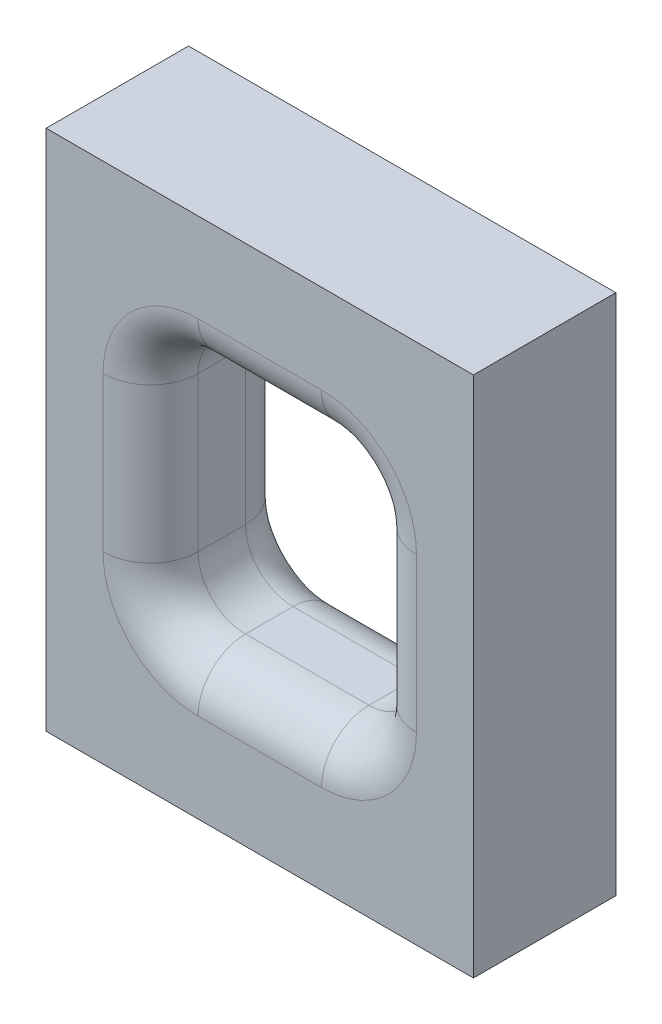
ISO-10303-21;
HEADER;
FILE_DESCRIPTION(('STEP AP214'),'2;1');
FILE_NAME('part.step','',(''),(''),'','','');
FILE_SCHEMA(('AUTOMOTIVE_DESIGN { 1 0 10303 214 1 1 1 1 }'));
ENDSEC;
DATA;
#1=APPLICATION_CONTEXT('core data for automotive mechanical design processes');
#2=APPLICATION_PROTOCOL_DEFINITION('international standard','automotive_design',2000,#1);
#3=PRODUCT_CONTEXT('',#1,'mechanical');
#4=PRODUCT('Part','Part','',(#3));
#5=PRODUCT_RELATED_PRODUCT_CATEGORY('part','',(#4));
#6=PRODUCT_DEFINITION_FORMATION('','',#4);
#7=PRODUCT_DEFINITION_CONTEXT('part definition',#1,'design');
#8=PRODUCT_DEFINITION('design','',#6,#7);
#9=PRODUCT_DEFINITION_SHAPE('','',#8);
#10=(LENGTH_UNIT() NAMED_UNIT(*) SI_UNIT(.MILLI.,.METRE.));
#11=(NAMED_UNIT(*) PLANE_ANGLE_UNIT() SI_UNIT($,.RADIAN.));
#12=(NAMED_UNIT(*) SI_UNIT($,.STERADIAN.) SOLID_ANGLE_UNIT());
#13=UNCERTAINTY_MEASURE_WITH_UNIT(LENGTH_MEASURE(1.E-05),#10,'distance_accuracy_value','');
#14=(GEOMETRIC_REPRESENTATION_CONTEXT(3) GLOBAL_UNCERTAINTY_ASSIGNED_CONTEXT((#13)) GLOBAL_UNIT_ASSIGNED_CONTEXT((#10,
#11,#12)) REPRESENTATION_CONTEXT('',''));
#15=CARTESIAN_POINT('',(0.,0.,0.));
#16=DIRECTION('',(0.,0.,1.));
#17=DIRECTION('',(1.,0.,0.));
#18=AXIS2_PLACEMENT_3D('',#15,#16,#17);
#19=CARTESIAN_POINT('',(0.,0.,3.));
#20=DIRECTION('',(0.,0.,-1.));
#21=DIRECTION('',(-1.,0.,0.));
#22=AXIS2_PLACEMENT_3D('',#19,#20,#21);
#23=PLANE('',#22);
#24=DIRECTION('',(0.,1.,0.));
#25=VECTOR('',#24,1.);
#26=CARTESIAN_POINT('',(3.3,-1.625,3.));
#27=LINE('',#26,#25);
#28=CARTESIAN_POINT('',(3.3,1.625,3.));
#29=VERTEX_POINT('',#28);
#30=CARTESIAN_POINT('',(3.3,-1.625,3.));
#31=VERTEX_POINT('',#30);
#32=EDGE_CURVE('E252',#29,#31,#27,.F.);
#33=ORIENTED_EDGE('',*,*,#32,.T.);
#34=CARTESIAN_POINT('',(1.3,-1.625,3.));
#35=DIRECTION('',(0.,0.,-1.));
#36=DIRECTION('',(-1.,0.,0.));
#37=AXIS2_PLACEMENT_3D('',#34,#35,#36);
#38=CIRCLE('',#37,2.);
#39=CARTESIAN_POINT('',(1.29999999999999,-3.625,3.));
#40=VERTEX_POINT('',#39);
#41=EDGE_CURVE('E263',#31,#40,#38,.T.);
#42=ORIENTED_EDGE('',*,*,#41,.T.);
#43=DIRECTION('',(1.,0.,0.));
#44=VECTOR('',#43,1.);
#45=CARTESIAN_POINT('',(-1.29999999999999,-3.625,3.));
#46=LINE('',#45,#44);
#47=CARTESIAN_POINT('',(-1.29999999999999,-3.625,3.));
#48=VERTEX_POINT('',#47);
#49=EDGE_CURVE('E57',#40,#48,#46,.F.);
#50=ORIENTED_EDGE('',*,*,#49,.T.);
#51=CARTESIAN_POINT('',(-1.3,-1.625,3.));
#52=DIRECTION('',(0.,0.,-1.));
#53=DIRECTION('',(-1.,0.,0.));
#54=AXIS2_PLACEMENT_3D('',#51,#52,#53);
#55=CIRCLE('',#54,2.);
#56=CARTESIAN_POINT('',(-3.3,-1.62499999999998,3.));
#57=VERTEX_POINT('',#56);
#58=EDGE_CURVE('E260',#48,#57,#55,.T.);
#59=ORIENTED_EDGE('',*,*,#58,.T.);
#60=DIRECTION('',(0.,-1.,0.));
#61=VECTOR('',#60,1.);
#62=CARTESIAN_POINT('',(-3.3,1.62499999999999,3.));
#63=LINE('',#62,#61);
#64=CARTESIAN_POINT('',(-3.3,1.62499999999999,3.));
#65=VERTEX_POINT('',#64);
#66=EDGE_CURVE('E258',#57,#65,#63,.F.);
#67=ORIENTED_EDGE('',*,*,#66,.T.);
#68=CARTESIAN_POINT('',(-1.3,1.625,3.));
#69=DIRECTION('',(0.,0.,-1.));
#70=DIRECTION('',(-1.,0.,0.));
#71=AXIS2_PLACEMENT_3D('',#68,#69,#70);
#72=CIRCLE('',#71,2.);
#73=CARTESIAN_POINT('',(-1.29999999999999,3.625,3.));
#74=VERTEX_POINT('',#73);
#75=EDGE_CURVE('E256',#65,#74,#72,.T.);
#76=ORIENTED_EDGE('',*,*,#75,.T.);
#77=DIRECTION('',(-1.,0.,0.));
#78=VECTOR('',#77,1.);
#79=CARTESIAN_POINT('',(1.29999999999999,3.625,3.));
#80=LINE('',#79,#78);
#81=CARTESIAN_POINT('',(1.29999999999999,3.625,3.));
#82=VERTEX_POINT('',#81);
#83=EDGE_CURVE('E254',#74,#82,#80,.F.);
#84=ORIENTED_EDGE('',*,*,#83,.T.);
#85=CARTESIAN_POINT('',(1.3,1.625,3.));
#86=DIRECTION('',(0.,0.,-1.));
#87=DIRECTION('',(-1.,0.,0.));
#88=AXIS2_PLACEMENT_3D('',#85,#86,#87);
#89=CIRCLE('',#88,2.);
#90=EDGE_CURVE('E250',#82,#29,#89,.T.);
#91=ORIENTED_EDGE('',*,*,#90,.T.);
#92=EDGE_LOOP('',(#33,#42,#50,#59,#67,#76,#84,#91));
#93=FACE_BOUND('',#92,.T.);
#94=DIRECTION('',(1.,0.,0.));
#95=VECTOR('',#94,1.);
#96=CARTESIAN_POINT('',(-4.5,-5.5,3.));
#97=LINE('',#96,#95);
#98=CARTESIAN_POINT('',(-4.5,-5.5,3.));
#99=VERTEX_POINT('',#98);
#100=CARTESIAN_POINT('',(4.5,-5.5,3.));
#101=VERTEX_POINT('',#100);
#102=EDGE_CURVE('E185',#99,#101,#97,.T.);
#103=ORIENTED_EDGE('',*,*,#102,.T.);
#104=DIRECTION('',(0.,1.,0.));
#105=VECTOR('',#104,1.);
#106=CARTESIAN_POINT('',(4.5,-4.49999999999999,3.));
#107=LINE('',#106,#105);
#108=CARTESIAN_POINT('',(4.49999999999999,5.5,3.));
#109=VERTEX_POINT('',#108);
#110=EDGE_CURVE('E173',#101,#109,#107,.T.);
#111=ORIENTED_EDGE('',*,*,#110,.T.);
#112=DIRECTION('',(-1.,0.,0.));
#113=VECTOR('',#112,1.);
#114=CARTESIAN_POINT('',(3.49999999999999,5.5,3.));
#115=LINE('',#114,#113);
#116=CARTESIAN_POINT('',(-4.50000000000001,5.5,3.));
#117=VERTEX_POINT('',#116);
#118=EDGE_CURVE('E184',#109,#117,#115,.T.);
#119=ORIENTED_EDGE('',*,*,#118,.T.);
#120=DIRECTION('',(0.,-1.,0.));
#121=VECTOR('',#120,1.);
#122=CARTESIAN_POINT('',(-4.50000000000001,4.5,3.));
#123=LINE('',#122,#121);
#124=EDGE_CURVE('E189',#117,#99,#123,.T.);
#125=ORIENTED_EDGE('',*,*,#124,.T.);
#126=EDGE_LOOP('',(#103,#111,#119,#125));
#127=FACE_BOUND('',#126,.T.);
#128=ADVANCED_FACE('F33',(#93,#127),#23,.F.);
#129=CARTESIAN_POINT('',(0.,0.,0.));
#130=DIRECTION('',(0.,0.,-1.));
#131=DIRECTION('',(-1.,0.,0.));
#132=AXIS2_PLACEMENT_3D('',#129,#130,#131);
#133=PLANE('',#132);
#134=DIRECTION('',(1.,0.,0.));
#135=VECTOR('',#134,1.);
#136=CARTESIAN_POINT('',(0.,-3.625,0.));
#137=LINE('',#136,#135);
#138=CARTESIAN_POINT('',(-1.29999999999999,-3.625,0.));
#139=VERTEX_POINT('',#138);
#140=CARTESIAN_POINT('',(1.29999999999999,-3.625,0.));
#141=VERTEX_POINT('',#140);
#142=EDGE_CURVE('E215',#139,#141,#137,.T.);
#143=ORIENTED_EDGE('',*,*,#142,.T.);
#144=CARTESIAN_POINT('',(1.3,-1.625,0.));
#145=DIRECTION('',(0.,0.,-1.));
#146=DIRECTION('',(-1.,0.,0.));
#147=AXIS2_PLACEMENT_3D('',#144,#145,#146);
#148=CIRCLE('',#147,2.);
#149=CARTESIAN_POINT('',(3.3,-1.625,0.));
#150=VERTEX_POINT('',#149);
#151=EDGE_CURVE('E217',#141,#150,#148,.F.);
#152=ORIENTED_EDGE('',*,*,#151,.T.);
#153=DIRECTION('',(0.,1.,0.));
#154=VECTOR('',#153,1.);
#155=CARTESIAN_POINT('',(3.3,0.,0.));
#156=LINE('',#155,#154);
#157=CARTESIAN_POINT('',(3.3,1.62499999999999,0.));
#158=VERTEX_POINT('',#157);
#159=EDGE_CURVE('E198',#150,#158,#156,.T.);
#160=ORIENTED_EDGE('',*,*,#159,.T.);
#161=CARTESIAN_POINT('',(1.3,1.625,0.));
#162=DIRECTION('',(0.,0.,-1.));
#163=DIRECTION('',(-1.,0.,0.));
#164=AXIS2_PLACEMENT_3D('',#161,#162,#163);
#165=CIRCLE('',#164,2.);
#166=CARTESIAN_POINT('',(1.29999999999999,3.625,0.));
#167=VERTEX_POINT('',#166);
#168=EDGE_CURVE('E200',#158,#167,#165,.F.);
#169=ORIENTED_EDGE('',*,*,#168,.T.);
#170=DIRECTION('',(-1.,0.,0.));
#171=VECTOR('',#170,1.);
#172=CARTESIAN_POINT('',(0.,3.625,0.));
#173=LINE('',#172,#171);
#174=CARTESIAN_POINT('',(-1.29999999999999,3.625,0.));
#175=VERTEX_POINT('',#174);
#176=EDGE_CURVE('E207',#167,#175,#173,.T.);
#177=ORIENTED_EDGE('',*,*,#176,.T.);
#178=CARTESIAN_POINT('',(-1.3,1.625,0.));
#179=DIRECTION('',(0.,0.,-1.));
#180=DIRECTION('',(-1.,0.,0.));
#181=AXIS2_PLACEMENT_3D('',#178,#179,#180);
#182=CIRCLE('',#181,2.);
#183=CARTESIAN_POINT('',(-3.3,1.62499999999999,0.));
#184=VERTEX_POINT('',#183);
#185=EDGE_CURVE('E209',#175,#184,#182,.F.);
#186=ORIENTED_EDGE('',*,*,#185,.T.);
#187=DIRECTION('',(0.,-1.,0.));
#188=VECTOR('',#187,1.);
#189=CARTESIAN_POINT('',(-3.3,0.,0.));
#190=LINE('',#189,#188);
#191=CARTESIAN_POINT('',(-3.3,-1.62499999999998,0.));
#192=VERTEX_POINT('',#191);
#193=EDGE_CURVE('E211',#184,#192,#190,.T.);
#194=ORIENTED_EDGE('',*,*,#193,.T.);
#195=CARTESIAN_POINT('',(-1.3,-1.625,0.));
#196=DIRECTION('',(0.,0.,-1.));
#197=DIRECTION('',(-1.,0.,0.));
#198=AXIS2_PLACEMENT_3D('',#195,#196,#197);
#199=CIRCLE('',#198,2.);
#200=EDGE_CURVE('E213',#192,#139,#199,.F.);
#201=ORIENTED_EDGE('',*,*,#200,.T.);
#202=EDGE_LOOP('',(#143,#152,#160,#169,#177,#186,#194,#201));
#203=FACE_BOUND('',#202,.T.);
#204=DIRECTION('',(1.,0.,0.));
#205=VECTOR('',#204,1.);
#206=CARTESIAN_POINT('',(-4.5,-5.5,0.));
#207=LINE('',#206,#205);
#208=CARTESIAN_POINT('',(-4.5,-5.5,0.));
#209=VERTEX_POINT('',#208);
#210=CARTESIAN_POINT('',(4.5,-5.5,0.));
#211=VERTEX_POINT('',#210);
#212=EDGE_CURVE('E197',#209,#211,#207,.T.);
#213=ORIENTED_EDGE('',*,*,#212,.F.);
#214=DIRECTION('',(0.,-1.,0.));
#215=VECTOR('',#214,1.);
#216=CARTESIAN_POINT('',(-4.5,-5.5,0.));
#217=LINE('',#216,#215);
#218=CARTESIAN_POINT('',(-4.50000000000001,5.5,0.));
#219=VERTEX_POINT('',#218);
#220=EDGE_CURVE('E193',#219,#209,#217,.T.);
#221=ORIENTED_EDGE('',*,*,#220,.F.);
#222=DIRECTION('',(-1.,0.,0.));
#223=VECTOR('',#222,1.);
#224=CARTESIAN_POINT('',(-4.50000000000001,5.5,0.));
#225=LINE('',#224,#223);
#226=CARTESIAN_POINT('',(4.49999999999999,5.5,0.));
#227=VERTEX_POINT('',#226);
#228=EDGE_CURVE('E364',#227,#219,#225,.T.);
#229=ORIENTED_EDGE('',*,*,#228,.F.);
#230=DIRECTION('',(0.,1.,0.));
#231=VECTOR('',#230,1.);
#232=CARTESIAN_POINT('',(4.49999999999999,5.5,0.));
#233=LINE('',#232,#231);
#234=EDGE_CURVE('E362',#211,#227,#233,.T.);
#235=ORIENTED_EDGE('',*,*,#234,.F.);
#236=EDGE_LOOP('',(#213,#221,#229,#235));
#237=FACE_BOUND('',#236,.T.);
#238=ADVANCED_FACE('F375',(#203,#237),#133,.T.);
#239=CARTESIAN_POINT('',(-4.5,-5.5,3.));
#240=DIRECTION('',(0.,1.,0.));
#241=DIRECTION('',(0.,0.,1.));
#242=AXIS2_PLACEMENT_3D('',#239,#240,#241);
#243=PLANE('',#242);
#244=ORIENTED_EDGE('',*,*,#212,.T.);
#245=DIRECTION('',(0.,0.,-1.));
#246=VECTOR('',#245,1.);
#247=CARTESIAN_POINT('',(4.5,-5.5,3.));
#248=LINE('',#247,#246);
#249=EDGE_CURVE('E178',#101,#211,#248,.T.);
#250=ORIENTED_EDGE('',*,*,#249,.F.);
#251=ORIENTED_EDGE('',*,*,#102,.F.);
#252=DIRECTION('',(0.,0.,-1.));
#253=VECTOR('',#252,1.);
#254=CARTESIAN_POINT('',(-4.5,-5.5,3.));
#255=LINE('',#254,#253);
#256=EDGE_CURVE('E360',#99,#209,#255,.T.);
#257=ORIENTED_EDGE('',*,*,#256,.T.);
#258=EDGE_LOOP('',(#244,#250,#251,#257));
#259=FACE_BOUND('',#258,.T.);
#260=ADVANCED_FACE('F195',(#259),#243,.F.);
#261=CARTESIAN_POINT('',(4.49999999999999,5.5,3.));
#262=DIRECTION('',(-1.,0.,0.));
#263=DIRECTION('',(0.,0.,1.));
#264=AXIS2_PLACEMENT_3D('',#261,#262,#263);
#265=PLANE('',#264);
#266=ORIENTED_EDGE('',*,*,#234,.T.);
#267=DIRECTION('',(0.,0.,-1.));
#268=VECTOR('',#267,1.);
#269=CARTESIAN_POINT('',(4.49999999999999,5.5,3.));
#270=LINE('',#269,#268);
#271=EDGE_CURVE('E181',#109,#227,#270,.T.);
#272=ORIENTED_EDGE('',*,*,#271,.F.);
#273=ORIENTED_EDGE('',*,*,#110,.F.);
#274=ORIENTED_EDGE('',*,*,#249,.T.);
#275=EDGE_LOOP('',(#266,#272,#273,#274));
#276=FACE_BOUND('',#275,.T.);
#277=ADVANCED_FACE('F176',(#276),#265,.F.);
#278=CARTESIAN_POINT('',(-4.50000000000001,5.5,3.));
#279=DIRECTION('',(0.,-1.,0.));
#280=DIRECTION('',(0.,0.,-1.));
#281=AXIS2_PLACEMENT_3D('',#278,#279,#280);
#282=PLANE('',#281);
#283=ORIENTED_EDGE('',*,*,#228,.T.);
#284=DIRECTION('',(0.,0.,-1.));
#285=VECTOR('',#284,1.);
#286=CARTESIAN_POINT('',(-4.50000000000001,5.5,3.));
#287=LINE('',#286,#285);
#288=EDGE_CURVE('E202',#117,#219,#287,.T.);
#289=ORIENTED_EDGE('',*,*,#288,.F.);
#290=ORIENTED_EDGE('',*,*,#118,.F.);
#291=ORIENTED_EDGE('',*,*,#271,.T.);
#292=EDGE_LOOP('',(#283,#289,#290,#291));
#293=FACE_BOUND('',#292,.T.);
#294=ADVANCED_FACE('F373',(#293),#282,.F.);
#295=CARTESIAN_POINT('',(-4.5,-5.5,3.));
#296=DIRECTION('',(1.,0.,0.));
#297=DIRECTION('',(0.,0.,-1.));
#298=AXIS2_PLACEMENT_3D('',#295,#296,#297);
#299=PLANE('',#298);
#300=ORIENTED_EDGE('',*,*,#220,.T.);
#301=ORIENTED_EDGE('',*,*,#256,.F.);
#302=ORIENTED_EDGE('',*,*,#124,.F.);
#303=ORIENTED_EDGE('',*,*,#288,.T.);
#304=EDGE_LOOP('',(#300,#301,#302,#303));
#305=FACE_BOUND('',#304,.T.);
#306=ADVANCED_FACE('F371',(#305),#299,.F.);
#307=CARTESIAN_POINT('',(1.3,1.625,3.));
#308=DIRECTION('',(0.,0.,-1.));
#309=DIRECTION('',(-1.,0.,0.));
#310=AXIS2_PLACEMENT_3D('',#307,#308,#309);
#311=CYLINDRICAL_SURFACE('',#310,1.);
#312=DIRECTION('',(0.,0.,-1.));
#313=VECTOR('',#312,1.);
#314=CARTESIAN_POINT('',(1.29999999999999,2.625,3.));
#315=LINE('',#314,#313);
#316=CARTESIAN_POINT('',(1.29999999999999,2.625,2.));
#317=VERTEX_POINT('',#316);
#318=CARTESIAN_POINT('',(1.29999999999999,2.625,1.));
#319=VERTEX_POINT('',#318);
#320=EDGE_CURVE('E355',#317,#319,#315,.T.);
#321=ORIENTED_EDGE('',*,*,#320,.T.);
#322=CARTESIAN_POINT('',(1.3,1.625,1.));
#323=DIRECTION('',(0.,0.,-1.));
#324=DIRECTION('',(-1.,0.,0.));
#325=AXIS2_PLACEMENT_3D('',#322,#323,#324);
#326=CIRCLE('',#325,1.);
#327=CARTESIAN_POINT('',(2.3,1.625,1.));
#328=VERTEX_POINT('',#327);
#329=EDGE_CURVE('E248',#319,#328,#326,.T.);
#330=ORIENTED_EDGE('',*,*,#329,.T.);
#331=DIRECTION('',(0.,0.,-1.));
#332=VECTOR('',#331,1.);
#333=CARTESIAN_POINT('',(2.3,1.625,3.));
#334=LINE('',#333,#332);
#335=CARTESIAN_POINT('',(2.3,1.625,2.));
#336=VERTEX_POINT('',#335);
#337=EDGE_CURVE('E288',#336,#328,#334,.T.);
#338=ORIENTED_EDGE('',*,*,#337,.F.);
#339=CARTESIAN_POINT('',(1.3,1.625,2.));
#340=DIRECTION('',(0.,0.,-1.));
#341=DIRECTION('',(-1.,0.,0.));
#342=AXIS2_PLACEMENT_3D('',#339,#340,#341);
#343=CIRCLE('',#342,1.);
#344=EDGE_CURVE('E246',#336,#317,#343,.F.);
#345=ORIENTED_EDGE('',*,*,#344,.T.);
#346=EDGE_LOOP('',(#321,#330,#338,#345));
#347=FACE_BOUND('',#346,.T.);
#348=ADVANCED_FACE('F389',(#347),#311,.F.);
#349=CARTESIAN_POINT('',(-1.29999999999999,2.625,3.));
#350=DIRECTION('',(0.,-1.,0.));
#351=DIRECTION('',(0.,0.,-1.));
#352=AXIS2_PLACEMENT_3D('',#349,#350,#351);
#353=PLANE('',#352);
#354=DIRECTION('',(0.,0.,-1.));
#355=VECTOR('',#354,1.);
#356=CARTESIAN_POINT('',(-1.29999999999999,2.625,3.));
#357=LINE('',#356,#355);
#358=CARTESIAN_POINT('',(-1.29999999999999,2.625,2.));
#359=VERTEX_POINT('',#358);
#360=CARTESIAN_POINT('',(-1.29999999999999,2.625,1.));
#361=VERTEX_POINT('',#360);
#362=EDGE_CURVE('E352',#359,#361,#357,.T.);
#363=ORIENTED_EDGE('',*,*,#362,.T.);
#364=DIRECTION('',(-1.,0.,0.));
#365=VECTOR('',#364,1.);
#366=CARTESIAN_POINT('',(-1.29999999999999,2.625,1.));
#367=LINE('',#366,#365);
#368=EDGE_CURVE('E244',#361,#319,#367,.F.);
#369=ORIENTED_EDGE('',*,*,#368,.T.);
#370=ORIENTED_EDGE('',*,*,#320,.F.);
#371=DIRECTION('',(-1.,0.,0.));
#372=VECTOR('',#371,1.);
#373=CARTESIAN_POINT('',(-1.29999999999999,2.625,2.));
#374=LINE('',#373,#372);
#375=EDGE_CURVE('E242',#317,#359,#374,.T.);
#376=ORIENTED_EDGE('',*,*,#375,.T.);
#377=EDGE_LOOP('',(#363,#369,#370,#376));
#378=FACE_BOUND('',#377,.T.);
#379=ADVANCED_FACE('F524',(#378),#353,.T.);
#380=CARTESIAN_POINT('',(-1.3,1.625,3.));
#381=DIRECTION('',(0.,0.,-1.));
#382=DIRECTION('',(-1.,0.,0.));
#383=AXIS2_PLACEMENT_3D('',#380,#381,#382);
#384=CYLINDRICAL_SURFACE('',#383,1.);
#385=DIRECTION('',(0.,0.,-1.));
#386=VECTOR('',#385,1.);
#387=CARTESIAN_POINT('',(-2.3,1.62499999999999,3.));
#388=LINE('',#387,#386);
#389=CARTESIAN_POINT('',(-2.3,1.62499999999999,2.));
#390=VERTEX_POINT('',#389);
#391=CARTESIAN_POINT('',(-2.3,1.62499999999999,1.));
#392=VERTEX_POINT('',#391);
#393=EDGE_CURVE('E349',#390,#392,#388,.T.);
#394=ORIENTED_EDGE('',*,*,#393,.T.);
#395=CARTESIAN_POINT('',(-1.3,1.625,1.));
#396=DIRECTION('',(0.,0.,-1.));
#397=DIRECTION('',(-1.,0.,0.));
#398=AXIS2_PLACEMENT_3D('',#395,#396,#397);
#399=CIRCLE('',#398,1.);
#400=EDGE_CURVE('E240',#392,#361,#399,.T.);
#401=ORIENTED_EDGE('',*,*,#400,.T.);
#402=ORIENTED_EDGE('',*,*,#362,.F.);
#403=CARTESIAN_POINT('',(-1.3,1.625,2.));
#404=DIRECTION('',(0.,0.,-1.));
#405=DIRECTION('',(-1.,0.,0.));
#406=AXIS2_PLACEMENT_3D('',#403,#404,#405);
#407=CIRCLE('',#406,1.);
#408=EDGE_CURVE('E238',#359,#390,#407,.F.);
#409=ORIENTED_EDGE('',*,*,#408,.T.);
#410=EDGE_LOOP('',(#394,#401,#402,#409));
#411=FACE_BOUND('',#410,.T.);
#412=ADVANCED_FACE('F516',(#411),#384,.F.);
#413=CARTESIAN_POINT('',(-2.3,1.62499999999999,3.));
#414=DIRECTION('',(1.,0.,0.));
#415=DIRECTION('',(0.,1.,0.));
#416=AXIS2_PLACEMENT_3D('',#413,#414,#415);
#417=PLANE('',#416);
#418=DIRECTION('',(0.,0.,-1.));
#419=VECTOR('',#418,1.);
#420=CARTESIAN_POINT('',(-2.3,-1.62499999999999,3.));
#421=LINE('',#420,#419);
#422=CARTESIAN_POINT('',(-2.3,-1.62499999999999,2.));
#423=VERTEX_POINT('',#422);
#424=CARTESIAN_POINT('',(-2.3,-1.62499999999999,1.));
#425=VERTEX_POINT('',#424);
#426=EDGE_CURVE('E342',#423,#425,#421,.T.);
#427=ORIENTED_EDGE('',*,*,#426,.T.);
#428=DIRECTION('',(0.,-1.,0.));
#429=VECTOR('',#428,1.);
#430=CARTESIAN_POINT('',(-2.3,1.62499999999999,1.));
#431=LINE('',#430,#429);
#432=EDGE_CURVE('E236',#425,#392,#431,.F.);
#433=ORIENTED_EDGE('',*,*,#432,.T.);
#434=ORIENTED_EDGE('',*,*,#393,.F.);
#435=DIRECTION('',(0.,-1.,0.));
#436=VECTOR('',#435,1.);
#437=CARTESIAN_POINT('',(-2.3,-1.62499999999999,2.));
#438=LINE('',#437,#436);
#439=EDGE_CURVE('E234',#390,#423,#438,.T.);
#440=ORIENTED_EDGE('',*,*,#439,.T.);
#441=EDGE_LOOP('',(#427,#433,#434,#440));
#442=FACE_BOUND('',#441,.T.);
#443=ADVANCED_FACE('F508',(#442),#417,.T.);
#444=CARTESIAN_POINT('',(-1.3,-1.625,3.));
#445=DIRECTION('',(0.,0.,-1.));
#446=DIRECTION('',(-1.,0.,0.));
#447=AXIS2_PLACEMENT_3D('',#444,#445,#446);
#448=CYLINDRICAL_SURFACE('',#447,1.);
#449=DIRECTION('',(0.,0.,-1.));
#450=VECTOR('',#449,1.);
#451=CARTESIAN_POINT('',(-1.29999999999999,-2.625,3.));
#452=LINE('',#451,#450);
#453=CARTESIAN_POINT('',(-1.29999999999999,-2.625,2.));
#454=VERTEX_POINT('',#453);
#455=CARTESIAN_POINT('',(-1.29999999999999,-2.625,1.));
#456=VERTEX_POINT('',#455);
#457=EDGE_CURVE('E334',#454,#456,#452,.T.);
#458=ORIENTED_EDGE('',*,*,#457,.T.);
#459=CARTESIAN_POINT('',(-1.3,-1.625,1.));
#460=DIRECTION('',(0.,0.,-1.));
#461=DIRECTION('',(-1.,0.,0.));
#462=AXIS2_PLACEMENT_3D('',#459,#460,#461);
#463=CIRCLE('',#462,1.);
#464=EDGE_CURVE('E232',#456,#425,#463,.T.);
#465=ORIENTED_EDGE('',*,*,#464,.T.);
#466=ORIENTED_EDGE('',*,*,#426,.F.);
#467=CARTESIAN_POINT('',(-1.3,-1.625,2.));
#468=DIRECTION('',(0.,0.,-1.));
#469=DIRECTION('',(-1.,0.,0.));
#470=AXIS2_PLACEMENT_3D('',#467,#468,#469);
#471=CIRCLE('',#470,1.);
#472=EDGE_CURVE('E230',#423,#454,#471,.F.);
#473=ORIENTED_EDGE('',*,*,#472,.T.);
#474=EDGE_LOOP('',(#458,#465,#466,#473));
#475=FACE_BOUND('',#474,.T.);
#476=ADVANCED_FACE('F501',(#475),#448,.F.);
#477=CARTESIAN_POINT('',(-1.29999999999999,-2.625,3.));
#478=DIRECTION('',(0.,1.,0.));
#479=DIRECTION('',(0.,0.,1.));
#480=AXIS2_PLACEMENT_3D('',#477,#478,#479);
#481=PLANE('',#480);
#482=DIRECTION('',(0.,0.,-1.));
#483=VECTOR('',#482,1.);
#484=CARTESIAN_POINT('',(1.29999999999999,-2.625,3.));
#485=LINE('',#484,#483);
#486=CARTESIAN_POINT('',(1.29999999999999,-2.625,2.));
#487=VERTEX_POINT('',#486);
#488=CARTESIAN_POINT('',(1.29999999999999,-2.625,1.));
#489=VERTEX_POINT('',#488);
#490=EDGE_CURVE('E332',#487,#489,#485,.T.);
#491=ORIENTED_EDGE('',*,*,#490,.T.);
#492=DIRECTION('',(1.,0.,0.));
#493=VECTOR('',#492,1.);
#494=CARTESIAN_POINT('',(-1.29999999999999,-2.625,1.));
#495=LINE('',#494,#493);
#496=EDGE_CURVE('E228',#489,#456,#495,.F.);
#497=ORIENTED_EDGE('',*,*,#496,.T.);
#498=ORIENTED_EDGE('',*,*,#457,.F.);
#499=DIRECTION('',(1.,0.,0.));
#500=VECTOR('',#499,1.);
#501=CARTESIAN_POINT('',(1.29999999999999,-2.625,2.));
#502=LINE('',#501,#500);
#503=EDGE_CURVE('E226',#454,#487,#502,.T.);
#504=ORIENTED_EDGE('',*,*,#503,.T.);
#505=EDGE_LOOP('',(#491,#497,#498,#504));
#506=FACE_BOUND('',#505,.T.);
#507=ADVANCED_FACE('F331',(#506),#481,.T.);
#508=CARTESIAN_POINT('',(1.3,-1.625,3.));
#509=DIRECTION('',(0.,0.,-1.));
#510=DIRECTION('',(-1.,0.,0.));
#511=AXIS2_PLACEMENT_3D('',#508,#509,#510);
#512=CYLINDRICAL_SURFACE('',#511,1.);
#513=DIRECTION('',(0.,0.,-1.));
#514=VECTOR('',#513,1.);
#515=CARTESIAN_POINT('',(2.3,-1.625,3.));
#516=LINE('',#515,#514);
#517=CARTESIAN_POINT('',(2.3,-1.625,2.));
#518=VERTEX_POINT('',#517);
#519=CARTESIAN_POINT('',(2.3,-1.625,1.));
#520=VERTEX_POINT('',#519);
#521=EDGE_CURVE('E340',#518,#520,#516,.T.);
#522=ORIENTED_EDGE('',*,*,#521,.T.);
#523=CARTESIAN_POINT('',(1.3,-1.625,1.));
#524=DIRECTION('',(0.,0.,-1.));
#525=DIRECTION('',(-1.,0.,0.));
#526=AXIS2_PLACEMENT_3D('',#523,#524,#525);
#527=CIRCLE('',#526,1.);
#528=EDGE_CURVE('E223',#520,#489,#527,.T.);
#529=ORIENTED_EDGE('',*,*,#528,.T.);
#530=ORIENTED_EDGE('',*,*,#490,.F.);
#531=CARTESIAN_POINT('',(1.3,-1.625,2.));
#532=DIRECTION('',(0.,0.,-1.));
#533=DIRECTION('',(-1.,0.,0.));
#534=AXIS2_PLACEMENT_3D('',#531,#532,#533);
#535=CIRCLE('',#534,1.);
#536=EDGE_CURVE('E220',#487,#518,#535,.F.);
#537=ORIENTED_EDGE('',*,*,#536,.T.);
#538=EDGE_LOOP('',(#522,#529,#530,#537));
#539=FACE_BOUND('',#538,.T.);
#540=ADVANCED_FACE('F337',(#539),#512,.F.);
#541=CARTESIAN_POINT('',(2.3,1.625,3.));
#542=DIRECTION('',(-1.,0.,0.));
#543=DIRECTION('',(0.,-1.,0.));
#544=AXIS2_PLACEMENT_3D('',#541,#542,#543);
#545=PLANE('',#544);
#546=ORIENTED_EDGE('',*,*,#521,.F.);
#547=DIRECTION('',(0.,1.,0.));
#548=VECTOR('',#547,1.);
#549=CARTESIAN_POINT('',(2.3,1.625,2.));
#550=LINE('',#549,#548);
#551=EDGE_CURVE('E11',#518,#336,#550,.T.);
#552=ORIENTED_EDGE('',*,*,#551,.T.);
#553=ORIENTED_EDGE('',*,*,#337,.T.);
#554=DIRECTION('',(0.,1.,0.));
#555=VECTOR('',#554,1.);
#556=CARTESIAN_POINT('',(2.3,1.625,1.));
#557=LINE('',#556,#555);
#558=EDGE_CURVE('E42',#328,#520,#557,.F.);
#559=ORIENTED_EDGE('',*,*,#558,.T.);
#560=EDGE_LOOP('',(#546,#552,#553,#559));
#561=FACE_BOUND('',#560,.T.);
#562=ADVANCED_FACE('F425',(#561),#545,.T.);
#563=CARTESIAN_POINT('',(-1.3,1.625,1.));
#564=DIRECTION('',(0.,0.,-1.));
#565=DIRECTION('',(-1.,0.,0.));
#566=AXIS2_PLACEMENT_3D('',#563,#564,#565);
#567=TOROIDAL_SURFACE('',#566,2.,1.);
#568=CARTESIAN_POINT('',(-1.29999999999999,3.625,1.));
#569=DIRECTION('',(1.,0.,0.));
#570=DIRECTION('',(0.,1.,0.));
#571=AXIS2_PLACEMENT_3D('',#568,#569,#570);
#572=CIRCLE('',#571,1.);
#573=EDGE_CURVE('E282',#361,#175,#572,.T.);
#574=ORIENTED_EDGE('',*,*,#573,.F.);
#575=ORIENTED_EDGE('',*,*,#400,.F.);
#576=CARTESIAN_POINT('',(-3.3,1.62499999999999,1.));
#577=DIRECTION('',(0.,-1.,0.));
#578=DIRECTION('',(1.,0.,0.));
#579=AXIS2_PLACEMENT_3D('',#576,#577,#578);
#580=CIRCLE('',#579,1.);
#581=EDGE_CURVE('E285',#184,#392,#580,.T.);
#582=ORIENTED_EDGE('',*,*,#581,.F.);
#583=ORIENTED_EDGE('',*,*,#185,.F.);
#584=EDGE_LOOP('',(#574,#575,#582,#583));
#585=FACE_BOUND('',#584,.T.);
#586=ADVANCED_FACE('F421',(#585),#567,.T.);
#587=CARTESIAN_POINT('',(-3.3,0.,1.));
#588=DIRECTION('',(0.,-1.,0.));
#589=DIRECTION('',(1.,0.,0.));
#590=AXIS2_PLACEMENT_3D('',#587,#588,#589);
#591=CYLINDRICAL_SURFACE('',#590,1.);
#592=ORIENTED_EDGE('',*,*,#581,.T.);
#593=ORIENTED_EDGE('',*,*,#432,.F.);
#594=CARTESIAN_POINT('',(-3.3,-1.62499999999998,1.));
#595=DIRECTION('',(0.,-1.,0.));
#596=DIRECTION('',(1.,0.,0.));
#597=AXIS2_PLACEMENT_3D('',#594,#595,#596);
#598=CIRCLE('',#597,1.);
#599=EDGE_CURVE('E279',#192,#425,#598,.T.);
#600=ORIENTED_EDGE('',*,*,#599,.F.);
#601=ORIENTED_EDGE('',*,*,#193,.F.);
#602=EDGE_LOOP('',(#592,#593,#600,#601));
#603=FACE_BOUND('',#602,.T.);
#604=ADVANCED_FACE('F417',(#603),#591,.T.);
#605=CARTESIAN_POINT('',(0.,3.625,1.));
#606=DIRECTION('',(-1.,0.,0.));
#607=DIRECTION('',(0.,0.,1.));
#608=AXIS2_PLACEMENT_3D('',#605,#606,#607);
#609=CYLINDRICAL_SURFACE('',#608,1.);
#610=ORIENTED_EDGE('',*,*,#573,.T.);
#611=ORIENTED_EDGE('',*,*,#176,.F.);
#612=CARTESIAN_POINT('',(1.29999999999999,3.625,1.));
#613=DIRECTION('',(1.,0.,0.));
#614=DIRECTION('',(0.,0.,-1.));
#615=AXIS2_PLACEMENT_3D('',#612,#613,#614);
#616=CIRCLE('',#615,1.);
#617=EDGE_CURVE('E276',#319,#167,#616,.T.);
#618=ORIENTED_EDGE('',*,*,#617,.F.);
#619=ORIENTED_EDGE('',*,*,#368,.F.);
#620=EDGE_LOOP('',(#610,#611,#618,#619));
#621=FACE_BOUND('',#620,.T.);
#622=ADVANCED_FACE('F413',(#621),#609,.T.);
#623=CARTESIAN_POINT('',(-1.3,-1.625,1.));
#624=DIRECTION('',(0.,0.,-1.));
#625=DIRECTION('',(-1.,0.,0.));
#626=AXIS2_PLACEMENT_3D('',#623,#624,#625);
#627=TOROIDAL_SURFACE('',#626,2.,1.);
#628=ORIENTED_EDGE('',*,*,#599,.T.);
#629=ORIENTED_EDGE('',*,*,#464,.F.);
#630=CARTESIAN_POINT('',(-1.29999999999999,-3.625,1.));
#631=DIRECTION('',(1.,0.,0.));
#632=DIRECTION('',(0.,0.,-1.));
#633=AXIS2_PLACEMENT_3D('',#630,#631,#632);
#634=CIRCLE('',#633,1.);
#635=EDGE_CURVE('E273',#139,#456,#634,.T.);
#636=ORIENTED_EDGE('',*,*,#635,.F.);
#637=ORIENTED_EDGE('',*,*,#200,.F.);
#638=EDGE_LOOP('',(#628,#629,#636,#637));
#639=FACE_BOUND('',#638,.T.);
#640=ADVANCED_FACE('F409',(#639),#627,.T.);
#641=CARTESIAN_POINT('',(1.3,1.625,1.));
#642=DIRECTION('',(0.,0.,-1.));
#643=DIRECTION('',(-1.,0.,0.));
#644=AXIS2_PLACEMENT_3D('',#641,#642,#643);
#645=TOROIDAL_SURFACE('',#644,2.,1.);
#646=ORIENTED_EDGE('',*,*,#617,.T.);
#647=ORIENTED_EDGE('',*,*,#168,.F.);
#648=CARTESIAN_POINT('',(3.3,1.62499999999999,1.));
#649=DIRECTION('',(0.,-1.,0.));
#650=DIRECTION('',(1.,0.,0.));
#651=AXIS2_PLACEMENT_3D('',#648,#649,#650);
#652=CIRCLE('',#651,1.);
#653=EDGE_CURVE('E270',#328,#158,#652,.T.);
#654=ORIENTED_EDGE('',*,*,#653,.F.);
#655=ORIENTED_EDGE('',*,*,#329,.F.);
#656=EDGE_LOOP('',(#646,#647,#654,#655));
#657=FACE_BOUND('',#656,.T.);
#658=ADVANCED_FACE('F405',(#657),#645,.T.);
#659=CARTESIAN_POINT('',(0.,-3.625,1.));
#660=DIRECTION('',(1.,0.,0.));
#661=DIRECTION('',(0.,0.,-1.));
#662=AXIS2_PLACEMENT_3D('',#659,#660,#661);
#663=CYLINDRICAL_SURFACE('',#662,1.);
#664=ORIENTED_EDGE('',*,*,#635,.T.);
#665=ORIENTED_EDGE('',*,*,#496,.F.);
#666=CARTESIAN_POINT('',(1.29999999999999,-3.625,1.));
#667=DIRECTION('',(1.,0.,0.));
#668=DIRECTION('',(0.,1.,0.));
#669=AXIS2_PLACEMENT_3D('',#666,#667,#668);
#670=CIRCLE('',#669,1.);
#671=EDGE_CURVE('E268',#141,#489,#670,.T.);
#672=ORIENTED_EDGE('',*,*,#671,.F.);
#673=ORIENTED_EDGE('',*,*,#142,.F.);
#674=EDGE_LOOP('',(#664,#665,#672,#673));
#675=FACE_BOUND('',#674,.T.);
#676=ADVANCED_FACE('F401',(#675),#663,.T.);
#677=CARTESIAN_POINT('',(3.3,0.,1.));
#678=DIRECTION('',(0.,1.,0.));
#679=DIRECTION('',(-1.,0.,0.));
#680=AXIS2_PLACEMENT_3D('',#677,#678,#679);
#681=CYLINDRICAL_SURFACE('',#680,1.);
#682=ORIENTED_EDGE('',*,*,#653,.T.);
#683=ORIENTED_EDGE('',*,*,#159,.F.);
#684=CARTESIAN_POINT('',(3.3,-1.625,1.));
#685=DIRECTION('',(0.,-1.,0.));
#686=DIRECTION('',(0.,0.,-1.));
#687=AXIS2_PLACEMENT_3D('',#684,#685,#686);
#688=CIRCLE('',#687,1.);
#689=EDGE_CURVE('E266',#520,#150,#688,.T.);
#690=ORIENTED_EDGE('',*,*,#689,.F.);
#691=ORIENTED_EDGE('',*,*,#558,.F.);
#692=EDGE_LOOP('',(#682,#683,#690,#691));
#693=FACE_BOUND('',#692,.T.);
#694=ADVANCED_FACE('F397',(#693),#681,.T.);
#695=CARTESIAN_POINT('',(1.3,-1.625,1.));
#696=DIRECTION('',(0.,0.,-1.));
#697=DIRECTION('',(-1.,0.,0.));
#698=AXIS2_PLACEMENT_3D('',#695,#696,#697);
#699=TOROIDAL_SURFACE('',#698,2.,1.);
#700=ORIENTED_EDGE('',*,*,#671,.T.);
#701=ORIENTED_EDGE('',*,*,#528,.F.);
#702=ORIENTED_EDGE('',*,*,#689,.T.);
#703=ORIENTED_EDGE('',*,*,#151,.F.);
#704=EDGE_LOOP('',(#700,#701,#702,#703));
#705=FACE_BOUND('',#704,.T.);
#706=ADVANCED_FACE('F394',(#705),#699,.T.);
#707=CARTESIAN_POINT('',(-1.3,1.625,2.));
#708=DIRECTION('',(0.,0.,-1.));
#709=DIRECTION('',(-1.,0.,0.));
#710=AXIS2_PLACEMENT_3D('',#707,#708,#709);
#711=TOROIDAL_SURFACE('',#710,2.,1.);
#712=CARTESIAN_POINT('',(-1.29999999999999,3.625,2.));
#713=DIRECTION('',(1.,0.,0.));
#714=DIRECTION('',(0.,1.,0.));
#715=AXIS2_PLACEMENT_3D('',#712,#713,#714);
#716=CIRCLE('',#715,1.);
#717=EDGE_CURVE('E303',#74,#359,#716,.T.);
#718=ORIENTED_EDGE('',*,*,#717,.F.);
#719=ORIENTED_EDGE('',*,*,#75,.F.);
#720=CARTESIAN_POINT('',(-3.3,1.62499999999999,2.));
#721=DIRECTION('',(0.,-1.,0.));
#722=DIRECTION('',(1.,0.,0.));
#723=AXIS2_PLACEMENT_3D('',#720,#721,#722);
#724=CIRCLE('',#723,1.);
#725=EDGE_CURVE('E37',#390,#65,#724,.T.);
#726=ORIENTED_EDGE('',*,*,#725,.F.);
#727=ORIENTED_EDGE('',*,*,#408,.F.);
#728=EDGE_LOOP('',(#718,#719,#726,#727));
#729=FACE_BOUND('',#728,.T.);
#730=ADVANCED_FACE('F35',(#729),#711,.T.);
#731=CARTESIAN_POINT('',(-3.3,1.62499999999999,2.));
#732=DIRECTION('',(0.,1.,0.));
#733=DIRECTION('',(-1.,0.,0.));
#734=AXIS2_PLACEMENT_3D('',#731,#732,#733);
#735=CYLINDRICAL_SURFACE('',#734,1.);
#736=ORIENTED_EDGE('',*,*,#725,.T.);
#737=ORIENTED_EDGE('',*,*,#66,.F.);
#738=CARTESIAN_POINT('',(-3.3,-1.62499999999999,2.));
#739=DIRECTION('',(0.,-1.,0.));
#740=DIRECTION('',(0.,0.,-1.));
#741=AXIS2_PLACEMENT_3D('',#738,#739,#740);
#742=CIRCLE('',#741,1.);
#743=EDGE_CURVE('E301',#423,#57,#742,.T.);
#744=ORIENTED_EDGE('',*,*,#743,.F.);
#745=ORIENTED_EDGE('',*,*,#439,.F.);
#746=EDGE_LOOP('',(#736,#737,#744,#745));
#747=FACE_BOUND('',#746,.T.);
#748=ADVANCED_FACE('F314',(#747),#735,.T.);
#749=CARTESIAN_POINT('',(-1.29999999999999,3.625,2.));
#750=DIRECTION('',(1.,0.,0.));
#751=DIRECTION('',(0.,0.,-1.));
#752=AXIS2_PLACEMENT_3D('',#749,#750,#751);
#753=CYLINDRICAL_SURFACE('',#752,1.);
#754=ORIENTED_EDGE('',*,*,#717,.T.);
#755=ORIENTED_EDGE('',*,*,#375,.F.);
#756=CARTESIAN_POINT('',(1.29999999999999,3.625,2.));
#757=DIRECTION('',(1.,0.,0.));
#758=DIRECTION('',(0.,0.,-1.));
#759=AXIS2_PLACEMENT_3D('',#756,#757,#758);
#760=CIRCLE('',#759,1.);
#761=EDGE_CURVE('E298',#82,#317,#760,.T.);
#762=ORIENTED_EDGE('',*,*,#761,.F.);
#763=ORIENTED_EDGE('',*,*,#83,.F.);
#764=EDGE_LOOP('',(#754,#755,#762,#763));
#765=FACE_BOUND('',#764,.T.);
#766=ADVANCED_FACE('F442',(#765),#753,.T.);
#767=CARTESIAN_POINT('',(-1.3,-1.625,2.));
#768=DIRECTION('',(0.,0.,-1.));
#769=DIRECTION('',(-1.,0.,0.));
#770=AXIS2_PLACEMENT_3D('',#767,#768,#769);
#771=TOROIDAL_SURFACE('',#770,2.,1.);
#772=ORIENTED_EDGE('',*,*,#743,.T.);
#773=ORIENTED_EDGE('',*,*,#58,.F.);
#774=CARTESIAN_POINT('',(-1.29999999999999,-3.625,2.));
#775=DIRECTION('',(1.,0.,0.));
#776=DIRECTION('',(0.,0.,-1.));
#777=AXIS2_PLACEMENT_3D('',#774,#775,#776);
#778=CIRCLE('',#777,1.);
#779=EDGE_CURVE('E295',#454,#48,#778,.T.);
#780=ORIENTED_EDGE('',*,*,#779,.F.);
#781=ORIENTED_EDGE('',*,*,#472,.F.);
#782=EDGE_LOOP('',(#772,#773,#780,#781));
#783=FACE_BOUND('',#782,.T.);
#784=ADVANCED_FACE('F322',(#783),#771,.T.);
#785=CARTESIAN_POINT('',(1.3,1.625,2.));
#786=DIRECTION('',(0.,0.,-1.));
#787=DIRECTION('',(-1.,0.,0.));
#788=AXIS2_PLACEMENT_3D('',#785,#786,#787);
#789=TOROIDAL_SURFACE('',#788,2.,1.);
#790=ORIENTED_EDGE('',*,*,#761,.T.);
#791=ORIENTED_EDGE('',*,*,#344,.F.);
#792=CARTESIAN_POINT('',(3.3,1.625,2.));
#793=DIRECTION('',(0.,-1.,0.));
#794=DIRECTION('',(1.,0.,0.));
#795=AXIS2_PLACEMENT_3D('',#792,#793,#794);
#796=CIRCLE('',#795,1.);
#797=EDGE_CURVE('E292',#29,#336,#796,.T.);
#798=ORIENTED_EDGE('',*,*,#797,.F.);
#799=ORIENTED_EDGE('',*,*,#90,.F.);
#800=EDGE_LOOP('',(#790,#791,#798,#799));
#801=FACE_BOUND('',#800,.T.);
#802=ADVANCED_FACE('F436',(#801),#789,.T.);
#803=CARTESIAN_POINT('',(-1.29999999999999,-3.625,2.));
#804=DIRECTION('',(-1.,0.,0.));
#805=DIRECTION('',(0.,0.,1.));
#806=AXIS2_PLACEMENT_3D('',#803,#804,#805);
#807=CYLINDRICAL_SURFACE('',#806,1.);
#808=ORIENTED_EDGE('',*,*,#779,.T.);
#809=ORIENTED_EDGE('',*,*,#49,.F.);
#810=CARTESIAN_POINT('',(1.29999999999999,-3.625,2.));
#811=DIRECTION('',(1.,0.,0.));
#812=DIRECTION('',(0.,0.,-1.));
#813=AXIS2_PLACEMENT_3D('',#810,#811,#812);
#814=CIRCLE('',#813,1.);
#815=EDGE_CURVE('E50',#487,#40,#814,.T.);
#816=ORIENTED_EDGE('',*,*,#815,.F.);
#817=ORIENTED_EDGE('',*,*,#503,.F.);
#818=EDGE_LOOP('',(#808,#809,#816,#817));
#819=FACE_BOUND('',#818,.T.);
#820=ADVANCED_FACE('F326',(#819),#807,.T.);
#821=CARTESIAN_POINT('',(3.3,1.625,2.));
#822=DIRECTION('',(0.,-1.,0.));
#823=DIRECTION('',(1.,0.,0.));
#824=AXIS2_PLACEMENT_3D('',#821,#822,#823);
#825=CYLINDRICAL_SURFACE('',#824,1.);
#826=ORIENTED_EDGE('',*,*,#797,.T.);
#827=ORIENTED_EDGE('',*,*,#551,.F.);
#828=CARTESIAN_POINT('',(3.3,-1.625,2.));
#829=DIRECTION('',(0.,-1.,0.));
#830=DIRECTION('',(0.,0.,-1.));
#831=AXIS2_PLACEMENT_3D('',#828,#829,#830);
#832=CIRCLE('',#831,1.);
#833=EDGE_CURVE('E289',#31,#518,#832,.T.);
#834=ORIENTED_EDGE('',*,*,#833,.F.);
#835=ORIENTED_EDGE('',*,*,#32,.F.);
#836=EDGE_LOOP('',(#826,#827,#834,#835));
#837=FACE_BOUND('',#836,.T.);
#838=ADVANCED_FACE('F430',(#837),#825,.T.);
#839=CARTESIAN_POINT('',(1.3,-1.625,2.));
#840=DIRECTION('',(0.,0.,-1.));
#841=DIRECTION('',(-1.,0.,0.));
#842=AXIS2_PLACEMENT_3D('',#839,#840,#841);
#843=TOROIDAL_SURFACE('',#842,2.,1.);
#844=ORIENTED_EDGE('',*,*,#815,.T.);
#845=ORIENTED_EDGE('',*,*,#41,.F.);
#846=ORIENTED_EDGE('',*,*,#833,.T.);
#847=ORIENTED_EDGE('',*,*,#536,.F.);
#848=EDGE_LOOP('',(#844,#845,#846,#847));
#849=FACE_BOUND('',#848,.T.);
#850=ADVANCED_FACE('F427',(#849),#843,.T.);
#851=CLOSED_SHELL('',(#128,#238,#260,#277,#294,#306,#348,#379,#412,#443,#476,#507,#540,#562,
#586,#604,#622,#640,#658,#676,#694,#706,#730,#748,#766,#784,#802,#820,#838,#850));
#852=MANIFOLD_SOLID_BREP('B2',#851);
#853=ADVANCED_BREP_SHAPE_REPRESENTATION('',(#18,#852),#14);
#854=SHAPE_DEFINITION_REPRESENTATION(#9,#853);
ENDSEC;
END-ISO-10303-21;
